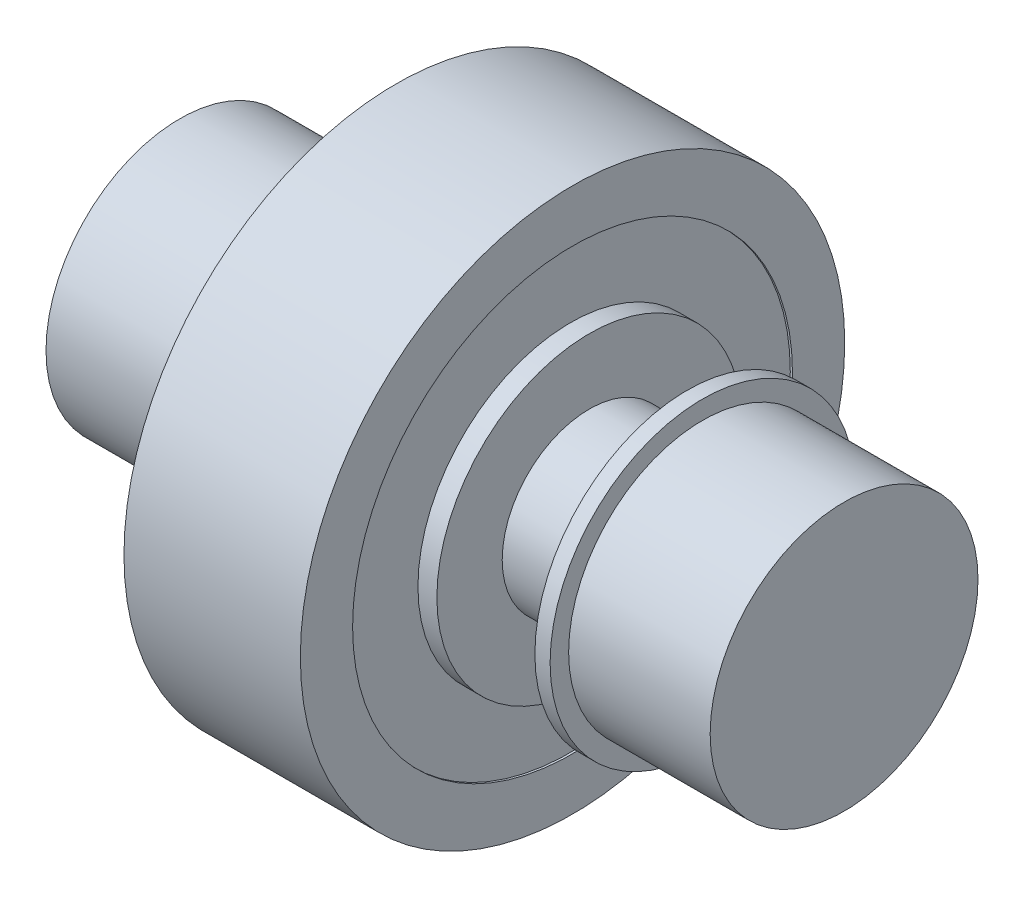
from build123d import *


with BuildPart() as part:
    # Schizzo1 → Rivoluzione1 (revolve)
    with BuildSketch(Plane.XY, mode=Mode.PRIVATE) as rivoluzione1_sk:
        Polygon((-152.5, 0), (152.5, 0), (152.5, 61.5), (87.5, 61.5), (87.5, 70), (80.5, 70), (80.5, 40), (35.5, 40), (35.5, 70), (26.8, 70), (26.8, 101), (-44.5, 101), (-44.5, 61.5), (-152.5, 61.5), align=None)
    revolve(rivoluzione1_sk.sketch.rotate(Axis((-1716.324322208, 0, 0), (1, 0, 0)), 90), axis=Axis((-1716.324322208, 0, 0), (1, 0, 0)))

    # Schizzo4 → Rivoluzione2 (revolve)
    with BuildSketch(Plane.XY, mode=Mode.PRIVATE) as rivoluzione2_sk:
        Polygon((-44.5, 0), (-44.5, 101), (-53.2, 101), (-53.2, 125), (27.8, 125), (27.8, 101), (26.8, 101), (26.8, 0), align=None)
    revolve(rivoluzione2_sk.sketch.rotate(Axis((152.5, 0, 0), (-1, 0, 0)), 90), axis=Axis((152.5, 0, 0), (-1, 0, 0)))


solid = part.part
